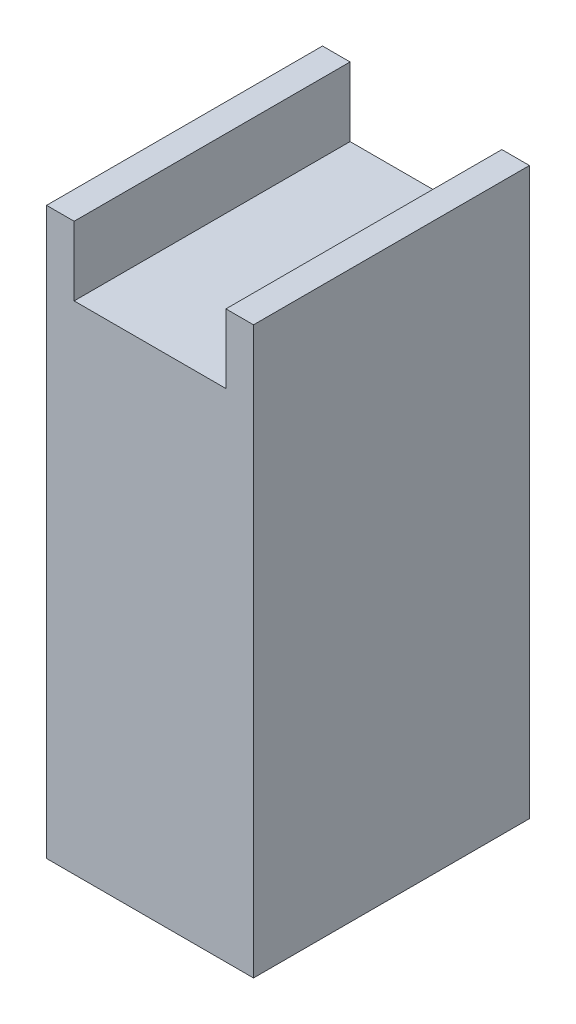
from build123d import *

# Parameters (mm, degrees)
BOSS_EXTRUDE1_DEPTH = 25.4


with BuildPart() as part:
    # Sketch1 → Boss-Extrude1 (new body)
    with BuildSketch(Plane.XY):
        Polygon((-9.525, 0), (-9.525, 52.07), (-6.985, 52.07), (-6.985, 45.72), (6.985, 45.72), (6.985, 52.07), (9.525, 52.07), (9.525, 0), align=None)
    extrude(amount=BOSS_EXTRUDE1_DEPTH)


solid = part.part
